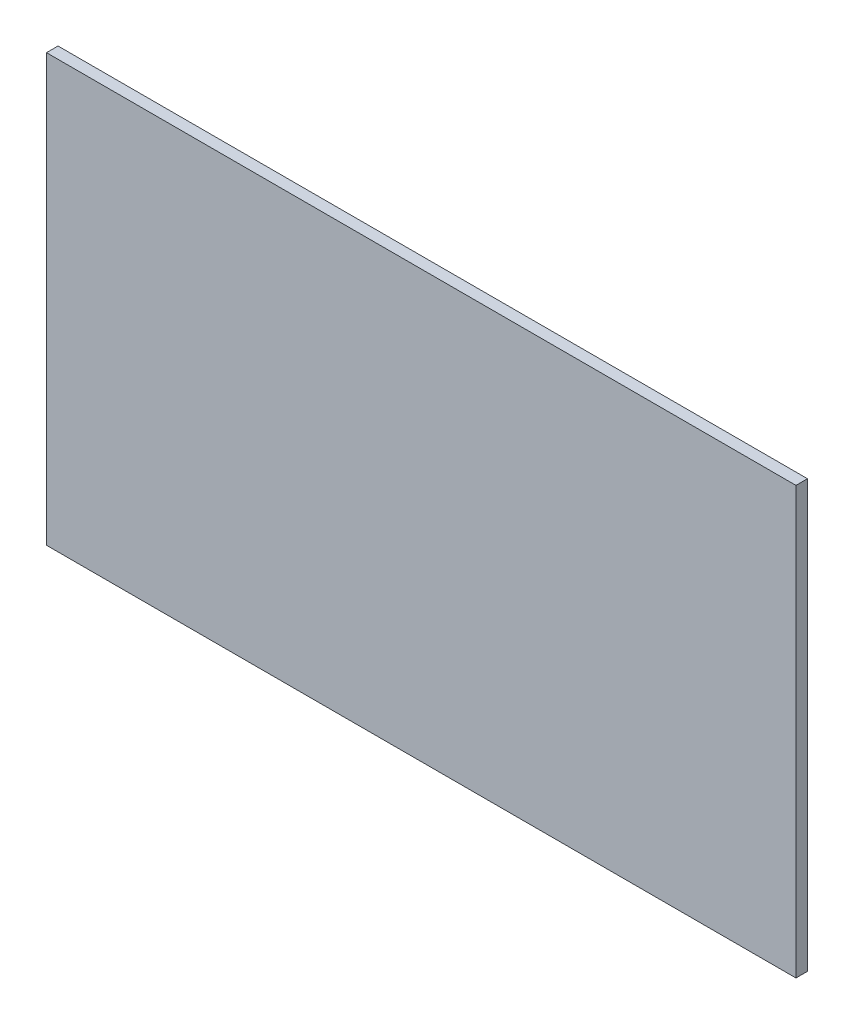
ISO-10303-21;
HEADER;
FILE_DESCRIPTION(('STEP AP214'),'2;1');
FILE_NAME('part.step','',(''),(''),'','','');
FILE_SCHEMA(('AUTOMOTIVE_DESIGN { 1 0 10303 214 1 1 1 1 }'));
ENDSEC;
DATA;
#1=APPLICATION_CONTEXT('core data for automotive mechanical design processes');
#2=APPLICATION_PROTOCOL_DEFINITION('international standard','automotive_design',2000,#1);
#3=PRODUCT_CONTEXT('',#1,'mechanical');
#4=PRODUCT('Part','Part','',(#3));
#5=PRODUCT_RELATED_PRODUCT_CATEGORY('part','',(#4));
#6=PRODUCT_DEFINITION_FORMATION('','',#4);
#7=PRODUCT_DEFINITION_CONTEXT('part definition',#1,'design');
#8=PRODUCT_DEFINITION('design','',#6,#7);
#9=PRODUCT_DEFINITION_SHAPE('','',#8);
#10=(LENGTH_UNIT() NAMED_UNIT(*) SI_UNIT(.MILLI.,.METRE.));
#11=(NAMED_UNIT(*) PLANE_ANGLE_UNIT() SI_UNIT($,.RADIAN.));
#12=(NAMED_UNIT(*) SI_UNIT($,.STERADIAN.) SOLID_ANGLE_UNIT());
#13=UNCERTAINTY_MEASURE_WITH_UNIT(LENGTH_MEASURE(1.E-05),#10,'distance_accuracy_value','');
#14=(GEOMETRIC_REPRESENTATION_CONTEXT(3) GLOBAL_UNCERTAINTY_ASSIGNED_CONTEXT((#13)) GLOBAL_UNIT_ASSIGNED_CONTEXT((#10,
#11,#12)) REPRESENTATION_CONTEXT('',''));
#15=CARTESIAN_POINT('',(0.,0.,0.));
#16=DIRECTION('',(0.,0.,1.));
#17=DIRECTION('',(1.,0.,0.));
#18=AXIS2_PLACEMENT_3D('',#15,#16,#17);
#19=CARTESIAN_POINT('',(412.75,-234.95,6.35));
#20=DIRECTION('',(-1.,0.,0.));
#21=DIRECTION('',(0.,0.,1.));
#22=AXIS2_PLACEMENT_3D('',#19,#20,#21);
#23=PLANE('',#22);
#24=DIRECTION('',(0.,1.,0.));
#25=VECTOR('',#24,1.);
#26=CARTESIAN_POINT('',(412.75,-234.95,-6.35));
#27=LINE('',#26,#25);
#28=CARTESIAN_POINT('',(412.75,-234.95,-6.35));
#29=VERTEX_POINT('',#28);
#30=CARTESIAN_POINT('',(412.75,234.95,-6.35));
#31=VERTEX_POINT('',#30);
#32=EDGE_CURVE('E93',#29,#31,#27,.T.);
#33=ORIENTED_EDGE('',*,*,#32,.T.);
#34=DIRECTION('',(0.,0.,-1.));
#35=VECTOR('',#34,1.);
#36=CARTESIAN_POINT('',(412.75,234.95,6.35));
#37=LINE('',#36,#35);
#38=CARTESIAN_POINT('',(412.75,234.95,6.35));
#39=VERTEX_POINT('',#38);
#40=EDGE_CURVE('E11',#39,#31,#37,.T.);
#41=ORIENTED_EDGE('',*,*,#40,.F.);
#42=DIRECTION('',(0.,1.,0.));
#43=VECTOR('',#42,1.);
#44=CARTESIAN_POINT('',(412.75,-234.95,6.35));
#45=LINE('',#44,#43);
#46=CARTESIAN_POINT('',(412.75,-234.95,6.35));
#47=VERTEX_POINT('',#46);
#48=EDGE_CURVE('E81',#47,#39,#45,.T.);
#49=ORIENTED_EDGE('',*,*,#48,.F.);
#50=DIRECTION('',(0.,0.,-1.));
#51=VECTOR('',#50,1.);
#52=CARTESIAN_POINT('',(412.75,-234.95,6.35));
#53=LINE('',#52,#51);
#54=EDGE_CURVE('E89',#47,#29,#53,.T.);
#55=ORIENTED_EDGE('',*,*,#54,.T.);
#56=EDGE_LOOP('',(#33,#41,#49,#55));
#57=FACE_BOUND('',#56,.T.);
#58=ADVANCED_FACE('F30',(#57),#23,.F.);
#59=CARTESIAN_POINT('',(-412.75,234.95,6.35));
#60=DIRECTION('',(0.,-1.,0.));
#61=DIRECTION('',(0.,0.,-1.));
#62=AXIS2_PLACEMENT_3D('',#59,#60,#61);
#63=PLANE('',#62);
#64=DIRECTION('',(-1.,0.,0.));
#65=VECTOR('',#64,1.);
#66=CARTESIAN_POINT('',(-412.75,234.95,-6.35));
#67=LINE('',#66,#65);
#68=CARTESIAN_POINT('',(-412.75,234.95,-6.35));
#69=VERTEX_POINT('',#68);
#70=EDGE_CURVE('E85',#31,#69,#67,.T.);
#71=ORIENTED_EDGE('',*,*,#70,.T.);
#72=DIRECTION('',(0.,0.,-1.));
#73=VECTOR('',#72,1.);
#74=CARTESIAN_POINT('',(-412.75,234.95,6.35));
#75=LINE('',#74,#73);
#76=CARTESIAN_POINT('',(-412.75,234.95,6.35));
#77=VERTEX_POINT('',#76);
#78=EDGE_CURVE('E38',#77,#69,#75,.T.);
#79=ORIENTED_EDGE('',*,*,#78,.F.);
#80=DIRECTION('',(-1.,0.,0.));
#81=VECTOR('',#80,1.);
#82=CARTESIAN_POINT('',(-412.75,234.95,6.35));
#83=LINE('',#82,#81);
#84=EDGE_CURVE('E76',#39,#77,#83,.T.);
#85=ORIENTED_EDGE('',*,*,#84,.F.);
#86=ORIENTED_EDGE('',*,*,#40,.T.);
#87=EDGE_LOOP('',(#71,#79,#85,#86));
#88=FACE_BOUND('',#87,.T.);
#89=ADVANCED_FACE('F84',(#88),#63,.F.);
#90=CARTESIAN_POINT('',(-412.75,-234.95,6.35));
#91=DIRECTION('',(1.,0.,0.));
#92=DIRECTION('',(0.,0.,-1.));
#93=AXIS2_PLACEMENT_3D('',#90,#91,#92);
#94=PLANE('',#93);
#95=DIRECTION('',(0.,-1.,0.));
#96=VECTOR('',#95,1.);
#97=CARTESIAN_POINT('',(-412.75,-234.95,-6.35));
#98=LINE('',#97,#96);
#99=CARTESIAN_POINT('',(-412.75,-234.95,-6.35));
#100=VERTEX_POINT('',#99);
#101=EDGE_CURVE('E63',#69,#100,#98,.T.);
#102=ORIENTED_EDGE('',*,*,#101,.T.);
#103=DIRECTION('',(0.,0.,-1.));
#104=VECTOR('',#103,1.);
#105=CARTESIAN_POINT('',(-412.75,-234.95,6.35));
#106=LINE('',#105,#104);
#107=CARTESIAN_POINT('',(-412.75,-234.95,6.35));
#108=VERTEX_POINT('',#107);
#109=EDGE_CURVE('E86',#108,#100,#106,.T.);
#110=ORIENTED_EDGE('',*,*,#109,.F.);
#111=DIRECTION('',(0.,-1.,0.));
#112=VECTOR('',#111,1.);
#113=CARTESIAN_POINT('',(-412.75,-234.95,6.35));
#114=LINE('',#113,#112);
#115=EDGE_CURVE('E79',#77,#108,#114,.T.);
#116=ORIENTED_EDGE('',*,*,#115,.F.);
#117=ORIENTED_EDGE('',*,*,#78,.T.);
#118=EDGE_LOOP('',(#102,#110,#116,#117));
#119=FACE_BOUND('',#118,.T.);
#120=ADVANCED_FACE('F87',(#119),#94,.F.);
#121=CARTESIAN_POINT('',(-412.75,-234.95,6.35));
#122=DIRECTION('',(0.,1.,0.));
#123=DIRECTION('',(0.,0.,1.));
#124=AXIS2_PLACEMENT_3D('',#121,#122,#123);
#125=PLANE('',#124);
#126=DIRECTION('',(1.,0.,0.));
#127=VECTOR('',#126,1.);
#128=CARTESIAN_POINT('',(-412.75,-234.95,-6.35));
#129=LINE('',#128,#127);
#130=EDGE_CURVE('E69',#100,#29,#129,.T.);
#131=ORIENTED_EDGE('',*,*,#130,.T.);
#132=ORIENTED_EDGE('',*,*,#54,.F.);
#133=DIRECTION('',(1.,0.,0.));
#134=VECTOR('',#133,1.);
#135=CARTESIAN_POINT('',(-412.75,-234.95,6.35));
#136=LINE('',#135,#134);
#137=EDGE_CURVE('E46',#108,#47,#136,.T.);
#138=ORIENTED_EDGE('',*,*,#137,.F.);
#139=ORIENTED_EDGE('',*,*,#109,.T.);
#140=EDGE_LOOP('',(#131,#132,#138,#139));
#141=FACE_BOUND('',#140,.T.);
#142=ADVANCED_FACE('F100',(#141),#125,.F.);
#143=CARTESIAN_POINT('',(412.75,234.95,6.35));
#144=DIRECTION('',(0.,0.,-1.));
#145=DIRECTION('',(-1.,0.,0.));
#146=AXIS2_PLACEMENT_3D('',#143,#144,#145);
#147=PLANE('',#146);
#148=ORIENTED_EDGE('',*,*,#48,.T.);
#149=ORIENTED_EDGE('',*,*,#84,.T.);
#150=ORIENTED_EDGE('',*,*,#115,.T.);
#151=ORIENTED_EDGE('',*,*,#137,.T.);
#152=EDGE_LOOP('',(#148,#149,#150,#151));
#153=FACE_BOUND('',#152,.T.);
#154=ADVANCED_FACE('F77',(#153),#147,.F.);
#155=CARTESIAN_POINT('',(412.75,234.95,-6.35));
#156=DIRECTION('',(0.,0.,-1.));
#157=DIRECTION('',(-1.,0.,0.));
#158=AXIS2_PLACEMENT_3D('',#155,#156,#157);
#159=PLANE('',#158);
#160=ORIENTED_EDGE('',*,*,#32,.F.);
#161=ORIENTED_EDGE('',*,*,#130,.F.);
#162=ORIENTED_EDGE('',*,*,#101,.F.);
#163=ORIENTED_EDGE('',*,*,#70,.F.);
#164=EDGE_LOOP('',(#160,#161,#162,#163));
#165=FACE_BOUND('',#164,.T.);
#166=ADVANCED_FACE('F103',(#165),#159,.T.);
#167=CLOSED_SHELL('',(#58,#89,#120,#142,#154,#166));
#168=MANIFOLD_SOLID_BREP('B2',#167);
#169=ADVANCED_BREP_SHAPE_REPRESENTATION('',(#18,#168),#14);
#170=SHAPE_DEFINITION_REPRESENTATION(#9,#169);
ENDSEC;
END-ISO-10303-21;
